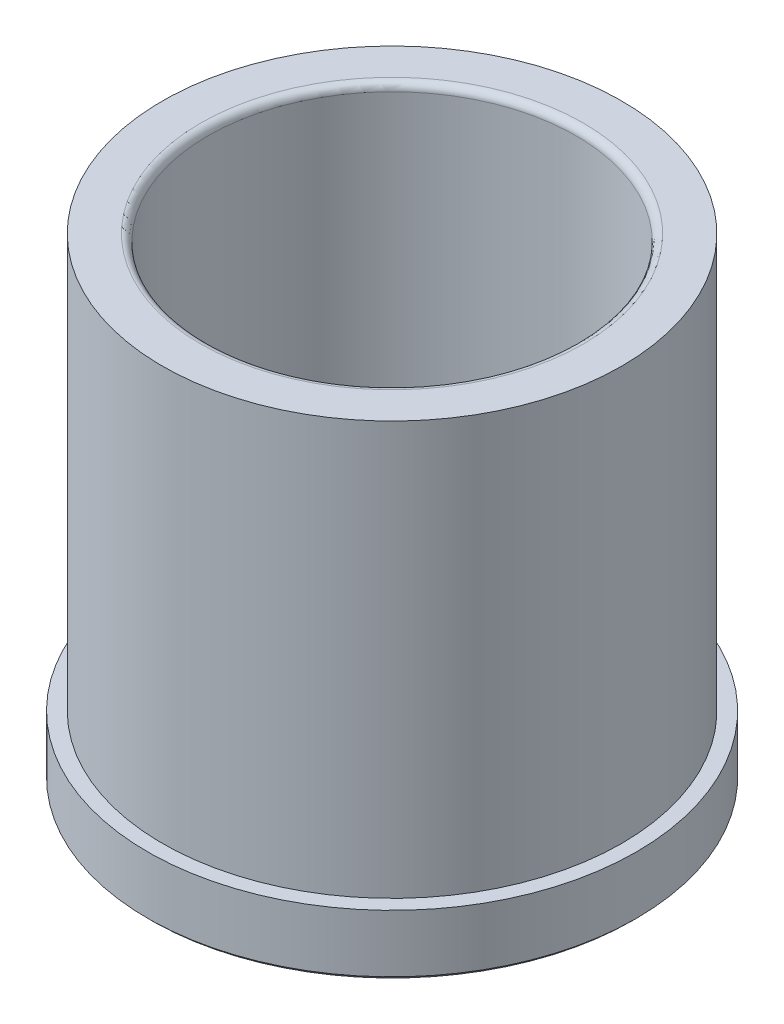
ISO-10303-21;
HEADER;
FILE_DESCRIPTION(('STEP AP214'),'2;1');
FILE_NAME('part.step','',(''),(''),'','','');
FILE_SCHEMA(('AUTOMOTIVE_DESIGN { 1 0 10303 214 1 1 1 1 }'));
ENDSEC;
DATA;
#1=APPLICATION_CONTEXT('core data for automotive mechanical design processes');
#2=APPLICATION_PROTOCOL_DEFINITION('international standard','automotive_design',2000,#1);
#3=PRODUCT_CONTEXT('',#1,'mechanical');
#4=PRODUCT('Part','Part','',(#3));
#5=PRODUCT_RELATED_PRODUCT_CATEGORY('part','',(#4));
#6=PRODUCT_DEFINITION_FORMATION('','',#4);
#7=PRODUCT_DEFINITION_CONTEXT('part definition',#1,'design');
#8=PRODUCT_DEFINITION('design','',#6,#7);
#9=PRODUCT_DEFINITION_SHAPE('','',#8);
#10=(LENGTH_UNIT() NAMED_UNIT(*) SI_UNIT(.MILLI.,.METRE.));
#11=(NAMED_UNIT(*) PLANE_ANGLE_UNIT() SI_UNIT($,.RADIAN.));
#12=(NAMED_UNIT(*) SI_UNIT($,.STERADIAN.) SOLID_ANGLE_UNIT());
#13=UNCERTAINTY_MEASURE_WITH_UNIT(LENGTH_MEASURE(1.E-05),#10,'distance_accuracy_value','');
#14=(GEOMETRIC_REPRESENTATION_CONTEXT(3) GLOBAL_UNCERTAINTY_ASSIGNED_CONTEXT((#13)) GLOBAL_UNIT_ASSIGNED_CONTEXT((#10,
#11,#12)) REPRESENTATION_CONTEXT('',''));
#15=CARTESIAN_POINT('',(0.,0.,0.));
#16=DIRECTION('',(0.,0.,1.));
#17=DIRECTION('',(1.,0.,0.));
#18=AXIS2_PLACEMENT_3D('',#15,#16,#17);
#19=CARTESIAN_POINT('',(3.49148336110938E-12,-1000.,0.));
#20=DIRECTION('',(0.,-1.,0.));
#21=DIRECTION('',(1.,0.,0.));
#22=AXIS2_PLACEMENT_3D('',#19,#20,#21);
#23=CYLINDRICAL_SURFACE('',#22,47.6313499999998);
#24=CARTESIAN_POINT('',(0.,12.7000000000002,0.));
#25=DIRECTION('',(0.,-1.,0.));
#26=DIRECTION('',(1.,0.,0.));
#27=AXIS2_PLACEMENT_3D('',#24,#25,#26);
#28=CIRCLE('',#27,47.6313499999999);
#29=CARTESIAN_POINT('',(47.6313499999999,12.7000000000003,0.));
#30=VERTEX_POINT('',#29);
#31=EDGE_CURVE('E39',#30,#30,#28,.T.);
#32=ORIENTED_EDGE('',*,*,#31,.F.);
#33=EDGE_LOOP('',(#32));
#34=FACE_BOUND('',#33,.T.);
#35=CARTESIAN_POINT('',(-3.43649249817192E-13,98.4250000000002,0.));
#36=DIRECTION('',(0.,-1.,0.));
#37=DIRECTION('',(1.,0.,0.));
#38=AXIS2_PLACEMENT_3D('',#35,#36,#37);
#39=CIRCLE('',#38,47.6313499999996);
#40=CARTESIAN_POINT('',(47.6313499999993,98.4250000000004,0.));
#41=VERTEX_POINT('',#40);
#42=EDGE_CURVE('E60',#41,#41,#39,.T.);
#43=ORIENTED_EDGE('',*,*,#42,.T.);
#44=EDGE_LOOP('',(#43));
#45=FACE_BOUND('',#44,.T.);
#46=ADVANCED_FACE('F28',(#34,#45),#23,.T.);
#47=CARTESIAN_POINT('',(-50.673,12.7,0.));
#48=DIRECTION('',(0.,-1.,0.));
#49=DIRECTION('',(1.,0.,0.));
#50=AXIS2_PLACEMENT_3D('',#47,#48,#49);
#51=PLANE('',#50);
#52=CARTESIAN_POINT('',(0.,12.7000000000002,0.));
#53=DIRECTION('',(0.,-1.,0.));
#54=DIRECTION('',(1.,0.,0.));
#55=AXIS2_PLACEMENT_3D('',#52,#53,#54);
#56=CIRCLE('',#55,50.673);
#57=CARTESIAN_POINT('',(50.6729999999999,12.7000000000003,0.));
#58=VERTEX_POINT('',#57);
#59=EDGE_CURVE('E43',#58,#58,#56,.T.);
#60=ORIENTED_EDGE('',*,*,#59,.F.);
#61=EDGE_LOOP('',(#60));
#62=FACE_BOUND('',#61,.T.);
#63=ORIENTED_EDGE('',*,*,#31,.T.);
#64=EDGE_LOOP('',(#63));
#65=FACE_BOUND('',#64,.T.);
#66=ADVANCED_FACE('F77',(#62,#65),#51,.F.);
#67=CARTESIAN_POINT('',(3.49148336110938E-12,-1000.,0.));
#68=DIRECTION('',(0.,-1.,0.));
#69=DIRECTION('',(1.,0.,0.));
#70=AXIS2_PLACEMENT_3D('',#67,#68,#69);
#71=CYLINDRICAL_SURFACE('',#70,50.673);
#72=CARTESIAN_POINT('',(0.,0.762000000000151,0.));
#73=DIRECTION('',(0.,-1.,0.));
#74=DIRECTION('',(1.,0.,0.));
#75=AXIS2_PLACEMENT_3D('',#72,#73,#74);
#76=CIRCLE('',#75,50.673);
#77=CARTESIAN_POINT('',(50.673,0.762000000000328,0.));
#78=VERTEX_POINT('',#77);
#79=EDGE_CURVE('E48',#78,#78,#76,.T.);
#80=ORIENTED_EDGE('',*,*,#79,.F.);
#81=EDGE_LOOP('',(#80));
#82=FACE_BOUND('',#81,.T.);
#83=ORIENTED_EDGE('',*,*,#59,.T.);
#84=EDGE_LOOP('',(#83));
#85=FACE_BOUND('',#84,.T.);
#86=ADVANCED_FACE('F82',(#82,#85),#71,.T.);
#87=CARTESIAN_POINT('',(0.,0.762000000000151,0.));
#88=DIRECTION('',(0.,1.,0.));
#89=DIRECTION('',(-1.,0.,0.));
#90=AXIS2_PLACEMENT_3D('',#87,#88,#89);
#91=CONICAL_SURFACE('',#90,50.673,0.785398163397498);
#92=CARTESIAN_POINT('',(0.,2.22044604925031E-13,0.));
#93=DIRECTION('',(0.,-1.,0.));
#94=DIRECTION('',(1.,0.,0.));
#95=AXIS2_PLACEMENT_3D('',#92,#93,#94);
#96=CIRCLE('',#95,49.911);
#97=CARTESIAN_POINT('',(49.911,3.96308030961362E-13,0.));
#98=VERTEX_POINT('',#97);
#99=EDGE_CURVE('E51',#98,#98,#96,.T.);
#100=ORIENTED_EDGE('',*,*,#99,.F.);
#101=EDGE_LOOP('',(#100));
#102=FACE_BOUND('',#101,.T.);
#103=ORIENTED_EDGE('',*,*,#79,.T.);
#104=EDGE_LOOP('',(#103));
#105=FACE_BOUND('',#104,.T.);
#106=ADVANCED_FACE('F89',(#102,#105),#91,.T.);
#107=CARTESIAN_POINT('',(-38.9255,0.,0.));
#108=DIRECTION('',(0.,1.,0.));
#109=DIRECTION('',(-1.,0.,0.));
#110=AXIS2_PLACEMENT_3D('',#107,#108,#109);
#111=PLANE('',#110);
#112=CARTESIAN_POINT('',(0.,2.22044604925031E-13,0.));
#113=DIRECTION('',(0.,-1.,0.));
#114=DIRECTION('',(1.,0.,0.));
#115=AXIS2_PLACEMENT_3D('',#112,#113,#114);
#116=CIRCLE('',#115,38.9255);
#117=CARTESIAN_POINT('',(38.9255,3.57952340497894E-13,0.));
#118=VERTEX_POINT('',#117);
#119=EDGE_CURVE('E54',#118,#118,#116,.T.);
#120=ORIENTED_EDGE('',*,*,#119,.F.);
#121=EDGE_LOOP('',(#120));
#122=FACE_BOUND('',#121,.T.);
#123=ORIENTED_EDGE('',*,*,#99,.T.);
#124=EDGE_LOOP('',(#123));
#125=FACE_BOUND('',#124,.T.);
#126=ADVANCED_FACE('F93',(#122,#125),#111,.F.);
#127=CARTESIAN_POINT('',(0.,2.22044604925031E-13,0.));
#128=DIRECTION('',(0.,-1.,0.));
#129=DIRECTION('',(1.,0.,0.));
#130=AXIS2_PLACEMENT_3D('',#127,#128,#129);
#131=CONICAL_SURFACE('',#130,38.9255,0.785398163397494);
#132=CARTESIAN_POINT('',(0.,0.762000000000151,0.));
#133=DIRECTION('',(0.,-1.,0.));
#134=DIRECTION('',(1.,0.,0.));
#135=AXIS2_PLACEMENT_3D('',#132,#133,#134);
#136=CIRCLE('',#135,38.1635);
#137=CARTESIAN_POINT('',(38.1635,0.762000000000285,0.));
#138=VERTEX_POINT('',#137);
#139=EDGE_CURVE('E57',#138,#138,#136,.T.);
#140=ORIENTED_EDGE('',*,*,#139,.F.);
#141=EDGE_LOOP('',(#140));
#142=FACE_BOUND('',#141,.T.);
#143=ORIENTED_EDGE('',*,*,#119,.T.);
#144=EDGE_LOOP('',(#143));
#145=FACE_BOUND('',#144,.T.);
#146=ADVANCED_FACE('F74',(#142,#145),#131,.F.);
#147=CARTESIAN_POINT('',(3.49148336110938E-12,-1000.,0.));
#148=DIRECTION('',(0.,-1.,0.));
#149=DIRECTION('',(1.,0.,0.));
#150=AXIS2_PLACEMENT_3D('',#147,#148,#149);
#151=CYLINDRICAL_SURFACE('',#150,38.1634999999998);
#152=CARTESIAN_POINT('',(-3.38328229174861E-13,96.9010000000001,0.));
#153=DIRECTION('',(0.,-1.,0.));
#154=DIRECTION('',(1.,0.,0.));
#155=AXIS2_PLACEMENT_3D('',#152,#153,#154);
#156=CIRCLE('',#155,38.1634999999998);
#157=CARTESIAN_POINT('',(38.1634999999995,96.9010000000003,0.));
#158=VERTEX_POINT('',#157);
#159=EDGE_CURVE('E10',#158,#158,#156,.F.);
#160=ORIENTED_EDGE('',*,*,#159,.T.);
#161=EDGE_LOOP('',(#160));
#162=FACE_BOUND('',#161,.T.);
#163=ORIENTED_EDGE('',*,*,#139,.T.);
#164=EDGE_LOOP('',(#163));
#165=FACE_BOUND('',#164,.T.);
#166=ADVANCED_FACE('F67',(#162,#165),#151,.F.);
#167=CARTESIAN_POINT('',(-47.63135,98.425,0.));
#168=DIRECTION('',(0.,-1.,0.));
#169=DIRECTION('',(1.,0.,0.));
#170=AXIS2_PLACEMENT_3D('',#167,#168,#169);
#171=PLANE('',#170);
#172=CARTESIAN_POINT('',(-3.43649249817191E-13,98.4250000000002,0.));
#173=DIRECTION('',(0.,-1.,0.));
#174=DIRECTION('',(1.,0.,0.));
#175=AXIS2_PLACEMENT_3D('',#172,#173,#174);
#176=CIRCLE('',#175,39.6874999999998);
#177=CARTESIAN_POINT('',(39.6874999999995,98.4250000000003,0.));
#178=VERTEX_POINT('',#177);
#179=EDGE_CURVE('E35',#178,#178,#176,.T.);
#180=ORIENTED_EDGE('',*,*,#179,.T.);
#181=EDGE_LOOP('',(#180));
#182=FACE_BOUND('',#181,.T.);
#183=ORIENTED_EDGE('',*,*,#42,.F.);
#184=EDGE_LOOP('',(#183));
#185=FACE_BOUND('',#184,.T.);
#186=ADVANCED_FACE('F65',(#182,#185),#171,.F.);
#187=CARTESIAN_POINT('',(-3.38328229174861E-13,96.9010000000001,0.));
#188=DIRECTION('',(0.,-1.,0.));
#189=DIRECTION('',(1.,0.,0.));
#190=AXIS2_PLACEMENT_3D('',#187,#188,#189);
#191=TOROIDAL_SURFACE('',#190,39.6874999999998,1.524);
#192=ORIENTED_EDGE('',*,*,#159,.F.);
#193=EDGE_LOOP('',(#192));
#194=FACE_BOUND('',#193,.T.);
#195=ORIENTED_EDGE('',*,*,#179,.F.);
#196=EDGE_LOOP('',(#195));
#197=FACE_BOUND('',#196,.T.);
#198=ADVANCED_FACE('F30',(#194,#197),#191,.T.);
#199=CLOSED_SHELL('',(#46,#66,#86,#106,#126,#146,#166,#186,#198));
#200=MANIFOLD_SOLID_BREP('B2',#199);
#201=ADVANCED_BREP_SHAPE_REPRESENTATION('',(#18,#200),#14);
#202=SHAPE_DEFINITION_REPRESENTATION(#9,#201);
ENDSEC;
END-ISO-10303-21;
